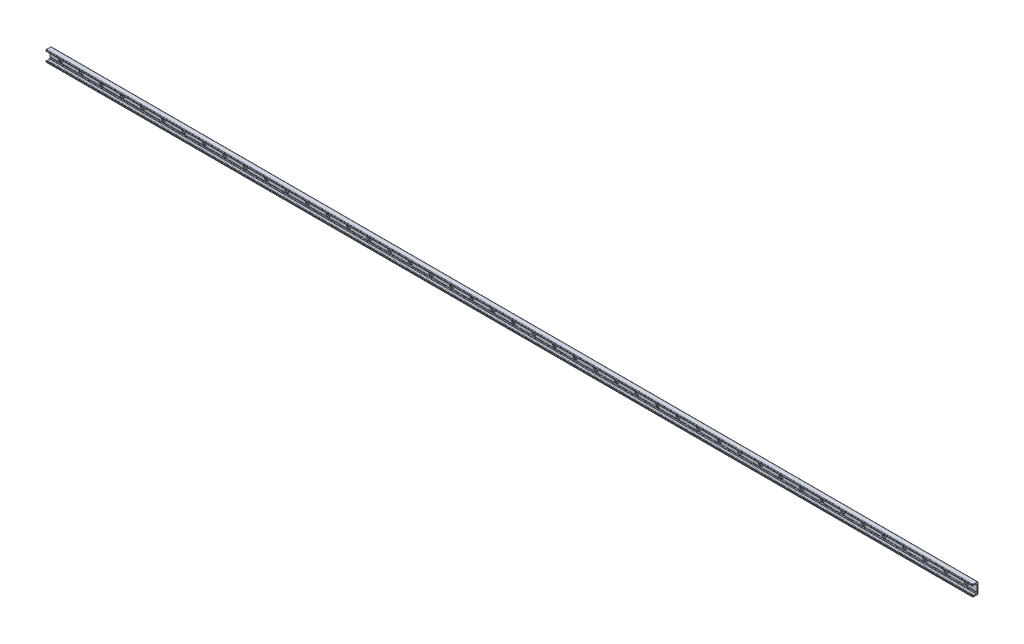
from build123d import *

# Parameters (mm, degrees)
BOSS_EXTRUDE1_DEPTH = 1800
SKETCH2_R           = 9
SKETCH2_R_2         = 4.5
CUT_EXTRUDE1_DEPTH  = 3.1
SKETCH2_2_R         = 4.5
CUT_EXTRUDE2_DEPTH  = 1801.204016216
LPATTERN1_COUNT     = 45
LPATTERN1_PITCH     = 80


with BuildPart() as part:
    # Sketch1 → Boss-Extrude1 (new, symmetric)
    with BuildSketch(Plane(origin=(0, 0, 0), x_dir=(0, 0, -1), z_dir=(1, 0, 0))):
        with BuildLine():
            Line((0, 0), (0, 19))
            ThreePointArc((0, 19), (-0.732233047, 20.767766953), (-2.5, 21.5))
            Line((-2.5, 21.5), (-19, 21.5))
            ThreePointArc((-19, 21.5), (-20.414213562, 20.914213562), (-21, 19.5))
            Line((-21, 19.5), (-21, 16.625057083))
            ThreePointArc((-21, 16.625057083), (-20.553251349, 15.888838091), (-19.693931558, 15.945160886))
            Line((-19.693931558, 15.945160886), (-16.794305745, 17.975500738))
            ThreePointArc((-16.794305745, 17.975500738), (-14.5, 18.69889256), (-12.205694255, 17.975500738))
            Line((-12.205694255, 17.975500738), (-8.829831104, 15.611695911))
            ThreePointArc((-8.829831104, 15.611695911), (-8.28408983, 15.342566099), (-7.682678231, 15.25))
            Line((-7.682678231, 15.25), (-6.5, 15.25))
            ThreePointArc((-6.5, 15.25), (-5.085786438, 14.664213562), (-4.5, 13.25))
            Line((-4.5, 13.25), (-4.5, -10.75))
            ThreePointArc((-4.5, -10.75), (-4.25, -11), (-4.5, -11.25))
            Line((-4.5, -11.25), (-4.5, -12.25))
            ThreePointArc((-4.5, -12.25), (-4.25, -12.5), (-4.5, -12.75))
            Line((-4.5, -12.75), (-4.5, -13.25))
            ThreePointArc((-4.5, -13.25), (-5.085786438, -14.664213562), (-6.5, -15.25))
            Line((-6.5, -15.25), (-7.682678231, -15.25))
            ThreePointArc((-7.682678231, -15.25), (-8.28408983, -15.342566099), (-8.829831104, -15.611695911))
            Line((-8.829831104, -15.611695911), (-12.205694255, -17.975500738))
            ThreePointArc((-12.205694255, -17.975500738), (-14.5, -18.69889256), (-16.794305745, -17.975500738))
            Line((-16.794305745, -17.975500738), (-19.693931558, -15.945160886))
            ThreePointArc((-19.693931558, -15.945160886), (-20.553251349, -15.888838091), (-21, -16.625057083))
            Line((-21, -16.625057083), (-21, -19.5))
            ThreePointArc((-21, -19.5), (-20.414213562, -20.914213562), (-19, -21.5))
            Line((-19, -21.5), (-2.5, -21.5))
            ThreePointArc((-2.5, -21.5), (-0.732233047, -20.767766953), (0, -19))
            Line((0, -19), (0, 0))
        make_face()
    extrude(amount=BOSS_EXTRUDE1_DEPTH, both=True)

    # Sketch2 → Cut-Extrude1 (cut)
    with BuildSketch(Plane.XY.offset(4.5)):
        with Locations((1760, 0)):
            Circle(SKETCH2_R)
        with Locations((1760, 0)):
            Circle(SKETCH2_R_2, mode=Mode.SUBTRACT)
    cut_extrude1 = extrude(amount=-CUT_EXTRUDE1_DEPTH, mode=Mode.SUBTRACT)

    # Sketch2_2 → Cut-Extrude2 (cut, through all)
    with BuildSketch(Plane.XY.offset(4.5)):
        with Locations((1760, 0)):
            Circle(SKETCH2_2_R)
    cut_extrude2 = extrude(amount=-CUT_EXTRUDE2_DEPTH, mode=Mode.SUBTRACT)

    # LPattern1: Cut-Extrude1, Cut-Extrude2 ×45
    with Locations(*[(-i * LPATTERN1_PITCH, 0, 0) for i in range(1, LPATTERN1_COUNT)]):
        add(cut_extrude1, mode=Mode.SUBTRACT)
        add(cut_extrude2, mode=Mode.SUBTRACT)


solid = part.part
